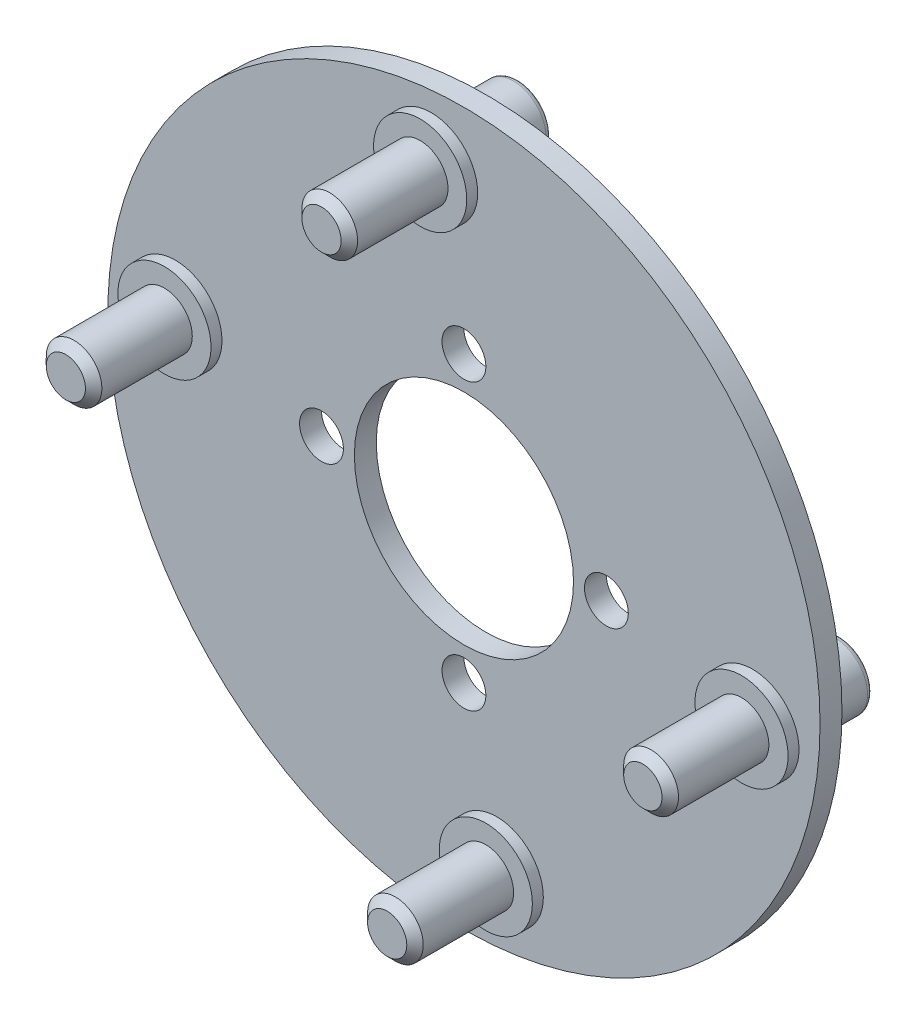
from build123d import *

# Parameters (mm, degrees)
ESQUISSE1_R                  = 32.5
ESQUISSE1_R_2                = 10
EXTRUSION1_DEPTH             = 2
ESQUISSE2_R                  = 2
ENL_V_MAT_EXTRU_1_DEPTH      = 47.005434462
R_P_TITION_CIRCULAIRE1_COUNT = 4
EXTRUSION2_DEPTH             = 1
EXTRUSION2_DEPTH_BACK        = 3.5
ESQUISSE3_R                  = 4.25
ESQUISSE4_R                  = 3
EXTRUSION3_DEPTH             = 4.5
CONG_1_R                     = 0.5
ESQUISSE5_R                  = 2.53945181
ESQUISSE5_R_2                = 2.5
EXTRUSION4_DEPTH             = 9
CHANFREIN1_SIZE              = 0.75


with BuildPart() as part:
    # Esquisse1 → Extrusion1 (new body)
    with BuildSketch(Plane.XY):
        Circle(ESQUISSE1_R)
        Circle(ESQUISSE1_R_2, mode=Mode.SUBTRACT)
    extrude(amount=EXTRUSION1_DEPTH)

    # Esquisse2 → Enl_v. mat.-Extru.1 (cut, through all)
    with BuildSketch(Plane(origin=(0, 0, 0), x_dir=(-1, 0, 0), z_dir=(0, 0, -1))):
        with Locations((0, 13)):
            Circle(ESQUISSE2_R)
    enl_v_mat_extru_1 = extrude(amount=-ENL_V_MAT_EXTRU_1_DEPTH, mode=Mode.SUBTRACT)

    # R_p_tition circulaire1: Enl_v. mat.-Extru.1 ×4 about axis
    r_p_tition_circulaire1_axis = Axis((0, 0, 0), (0, 0, 1))
    for i in range(1, R_P_TITION_CIRCULAIRE1_COUNT):
        add(enl_v_mat_extru_1.rotate(r_p_tition_circulaire1_axis, i * 360 / R_P_TITION_CIRCULAIRE1_COUNT), mode=Mode.SUBTRACT)

    # Esquisse3 → Extrusion2 (add, two sides: drawn at the far end of the back side and taken through both)
    with BuildSketch(Plane.XY.offset(2).offset(-EXTRUSION2_DEPTH_BACK)):
        with Locations((-2.995616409, 26.330140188)):
            Circle(ESQUISSE3_R)
        with Locations((-26.330140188, 2.995616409)):
            Circle(ESQUISSE3_R)
        with Locations((2.995616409, -26.330140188)):
            Circle(ESQUISSE3_R)
        with Locations((26.330140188, -2.995616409)):
            Circle(ESQUISSE3_R)
    extrude(amount=EXTRUSION2_DEPTH + EXTRUSION2_DEPTH_BACK)

    # Esquisse4 → Extrusion3 (add)
    with BuildSketch(Plane(origin=(0, 0, -1.5), x_dir=(-1, 0, 0), z_dir=(0, 0, -1))):
        with Locations(Location((2.995616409, 26.330140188, 0), (0, 0, 180))):
            Circle(ESQUISSE4_R)
        with Locations(Location((-26.330140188, -2.995616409, 0), (0, 0, 180))):
            Circle(ESQUISSE4_R)
        with Locations(Location((-2.995616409, -26.330140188, 0), (0, 0, 180))):
            Circle(ESQUISSE4_R)
        with Locations(Location((26.330140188, 2.995616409, 0), (0, 0, 180))):
            Circle(ESQUISSE4_R)
    extrude(amount=EXTRUSION3_DEPTH)

    # Cong_1
    cong_1_edges = [part.edges().sort_by_distance(p)[0] for p in [
        (-7.245616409, 26.330140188, -1.5),
        (-30.580140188, 2.995616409, -1.5),
        (-1.254383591, -26.330140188, -1.5),
        (22.080140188, -2.995616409, -1.5),
        (-5.995616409, 26.330140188, -6),
        (23.330140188, -2.995616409, -6),
        (-0.004383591, -26.330140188, -6),
        (-29.330140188, 2.995616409, -6),
    ]]
    fillet(cong_1_edges, radius=CONG_1_R)

    # Esquisse5 → Extrusion4 (add)
    with BuildSketch(Plane.XY.offset(3)):
        with Locations((-2.995616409, 26.330140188)):
            Circle(ESQUISSE5_R)
        with Locations((26.330140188, -2.995616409)):
            Circle(ESQUISSE5_R_2)
        with Locations((-26.330140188, 2.995616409)):
            Circle(ESQUISSE5_R)
        with Locations((2.995616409, -26.330140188)):
            Circle(ESQUISSE5_R)
    extrude(amount=EXTRUSION4_DEPTH)

    # Chanfrein1
    chanfrein1_edges = [part.edges().sort_by_distance(p)[0] for p in [
        (-28.869591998, 2.995616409, 12),
        (0.456164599, -26.330140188, 12),
        (-5.535068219, 26.330140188, 12),
        (23.830140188, -2.995616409, 12),
    ]]
    chamfer(chanfrein1_edges, length=CHANFREIN1_SIZE)


solid = part.part
